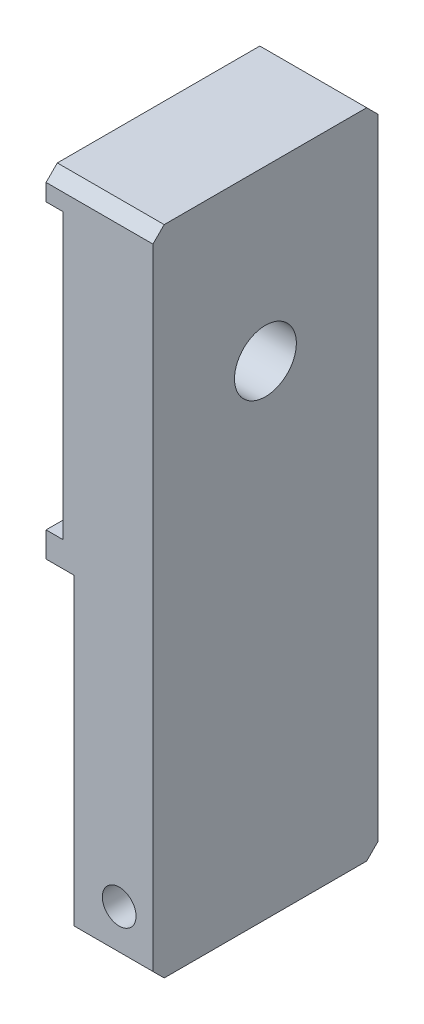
from build123d import *

# Parameters (mm, degrees)
EXTRUSION1_DEPTH        = 20
ENL_V_MAT_EXTRU_1_REACH = 121.235
ESQUISSE2_R             = 5.5
ENL_V_MAT_EXTRU_2_REACH = 125.499
ESQUISSE3_R             = 3
CHANFREIN1_SIZE         = 2


with BuildPart() as part:
    # Esquisse1 → Extrusion1 (new, symmetric)
    with BuildSketch(Plane.XY):
        Polygon((0, 0), (0, 56), (-5, 56), (-5, 60.5), (-2, 60.5), (-2, 111), (-5, 111), (-5, 116), (14, 116), (14, 0), align=None)
    extrude(amount=EXTRUSION1_DEPTH, both=True)

    # Esquisse2 → Enl_v. mat.-Extru.1 (cut, up to next)
    with BuildSketch(Plane(origin=(14, 0, 0), x_dir=(0, 0, -1), z_dir=(1, 0, 0)), mode=Mode.PRIVATE) as enl_v_mat_extru_1_sk1:
        with Locations(Location((0, 86, 0), (0, 0, 90))):
            Circle(ESQUISSE2_R)
    enl_v_mat_extru_1_tool1 = extrude(enl_v_mat_extru_1_sk1.sketch, amount=-ENL_V_MAT_EXTRU_1_REACH, mode=Mode.PRIVATE) & part.part
    add(enl_v_mat_extru_1_tool1.solids().sort_by_distance((14, 86, 0))[0], mode=Mode.SUBTRACT)

    # Esquisse3 → Enl_v. mat.-Extru.2 (cut, up to next)
    with BuildSketch(Plane.XY.offset(20), mode=Mode.PRIVATE) as enl_v_mat_extru_2_sk1:
        with Locations((8, 9)):
            Circle(ESQUISSE3_R)
    enl_v_mat_extru_2_tool1 = extrude(enl_v_mat_extru_2_sk1.sketch, amount=-ENL_V_MAT_EXTRU_2_REACH, mode=Mode.PRIVATE) & part.part
    add(enl_v_mat_extru_2_tool1.solids().sort_by_distance((8, 9, 20))[0], mode=Mode.SUBTRACT)

    # Chanfrein1
    chanfrein1_edges = [part.edges().sort_by_distance(p)[0] for p in [
        (4.5, 116, 20),
        (4.5, 116, -20),
        (7, 0, -20),
        (7, 0, 20),
    ]]
    chamfer(chanfrein1_edges, length=CHANFREIN1_SIZE)


solid = part.part
